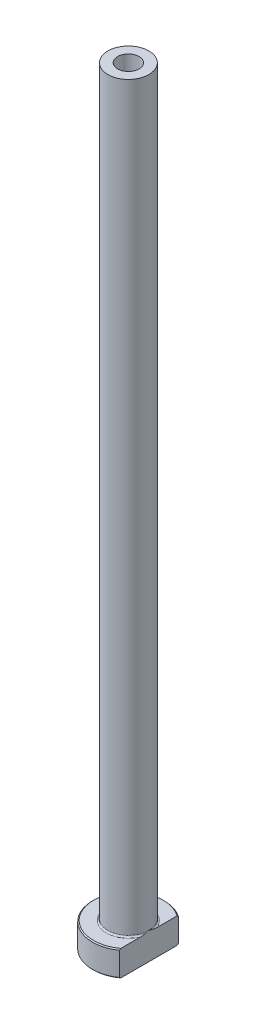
from build123d import *

# Parameters (mm, degrees)
FILLET1_R          = 0.3
CHAMFER1_SIZE      = 0.2
CUT_EXTRUDE1_DEPTH = 151.326311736
CHAMFER2_SIZE      = 0.5


with BuildPart() as part:
    # Sketch1 → Revolve1 (revolve)
    with BuildSketch(Plane.XY, mode=Mode.PRIVATE) as revolve1_sk:
        Polygon((-2.1, 150), (-4, 150), (-4, 5), (-7, 5), (-7, 0), (-2.35, 0), (-2.35, 93), (-2.1, 105), align=None)
    revolve(revolve1_sk.sketch.rotate(Axis((0, 92.187680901, 0), (0, -1, 0)), 270), axis=Axis((0, 92.187680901, 0), (0, -1, 0)))

    # Fillet1
    fillet1_edges = [part.edges().sort_by_distance(p)[0] for p in [
        (0, 5, -4),
    ]]
    fillet(fillet1_edges, radius=FILLET1_R)

    # Chamfer1
    chamfer1_edges = [part.edges().sort_by_distance(p)[0] for p in [
        (0, 0, -7),
        (0, 5, -7),
    ]]
    chamfer(chamfer1_edges, length=CHAMFER1_SIZE)

    # Sketch2 → Cut-Extrude1 (cut, through all)
    with BuildSketch(Plane.XZ):
        with BuildLine():
            Line((4, 5.744562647), (4, -5.744562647))
            ThreePointArc((4, -5.744562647), (7, 0), (4, 5.744562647))
        make_face()
    extrude(amount=-CUT_EXTRUDE1_DEPTH, mode=Mode.SUBTRACT)

    # Chamfer2
    chamfer2_edges = [part.edges().sort_by_distance(p)[0] for p in [
        (0, 0, -2.35),
    ]]
    chamfer(chamfer2_edges, length=CHAMFER2_SIZE)


solid = part.part
